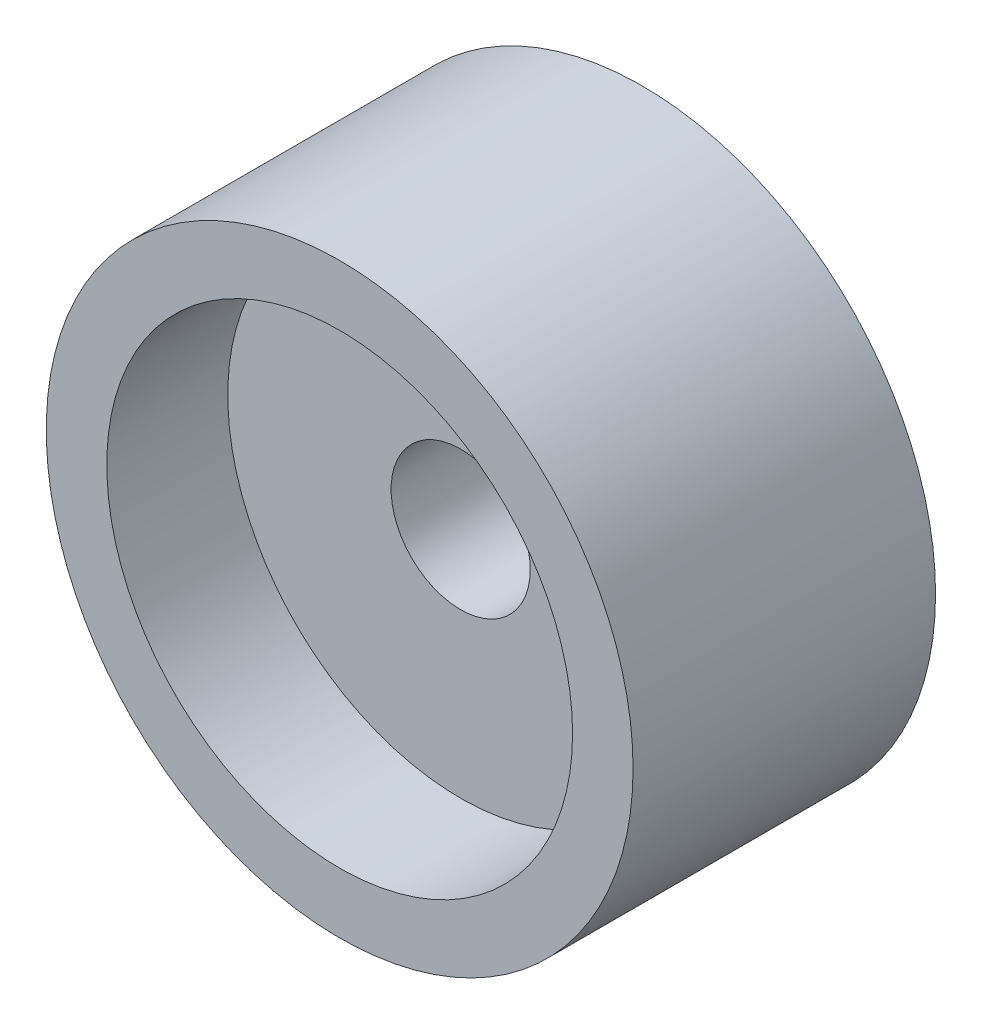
ISO-10303-21;
HEADER;
FILE_DESCRIPTION(('STEP AP214'),'2;1');
FILE_NAME('part.step','',(''),(''),'','','');
FILE_SCHEMA(('AUTOMOTIVE_DESIGN { 1 0 10303 214 1 1 1 1 }'));
ENDSEC;
DATA;
#1=APPLICATION_CONTEXT('core data for automotive mechanical design processes');
#2=APPLICATION_PROTOCOL_DEFINITION('international standard','automotive_design',2000,#1);
#3=PRODUCT_CONTEXT('',#1,'mechanical');
#4=PRODUCT('Part','Part','',(#3));
#5=PRODUCT_RELATED_PRODUCT_CATEGORY('part','',(#4));
#6=PRODUCT_DEFINITION_FORMATION('','',#4);
#7=PRODUCT_DEFINITION_CONTEXT('part definition',#1,'design');
#8=PRODUCT_DEFINITION('design','',#6,#7);
#9=PRODUCT_DEFINITION_SHAPE('','',#8);
#10=(LENGTH_UNIT() NAMED_UNIT(*) SI_UNIT(.MILLI.,.METRE.));
#11=(NAMED_UNIT(*) PLANE_ANGLE_UNIT() SI_UNIT($,.RADIAN.));
#12=(NAMED_UNIT(*) SI_UNIT($,.STERADIAN.) SOLID_ANGLE_UNIT());
#13=UNCERTAINTY_MEASURE_WITH_UNIT(LENGTH_MEASURE(1.E-05),#10,'distance_accuracy_value','');
#14=(GEOMETRIC_REPRESENTATION_CONTEXT(3) GLOBAL_UNCERTAINTY_ASSIGNED_CONTEXT((#13)) GLOBAL_UNIT_ASSIGNED_CONTEXT((#10,
#11,#12)) REPRESENTATION_CONTEXT('',''));
#15=CARTESIAN_POINT('',(0.,0.,0.));
#16=DIRECTION('',(0.,0.,1.));
#17=DIRECTION('',(1.,0.,0.));
#18=AXIS2_PLACEMENT_3D('',#15,#16,#17);
#19=CARTESIAN_POINT('',(0.,0.,2.));
#20=DIRECTION('',(0.,0.,-1.));
#21=DIRECTION('',(-1.,0.,0.));
#22=AXIS2_PLACEMENT_3D('',#19,#20,#21);
#23=CYLINDRICAL_SURFACE('',#22,3.85);
#24=CARTESIAN_POINT('',(0.,0.,2.));
#25=DIRECTION('',(0.,0.,1.));
#26=DIRECTION('',(1.,0.,0.));
#27=AXIS2_PLACEMENT_3D('',#24,#25,#26);
#28=CIRCLE('',#27,3.85);
#29=CARTESIAN_POINT('',(3.85,0.,2.));
#30=VERTEX_POINT('',#29);
#31=EDGE_CURVE('E47',#30,#30,#28,.T.);
#32=ORIENTED_EDGE('',*,*,#31,.T.);
#33=EDGE_LOOP('',(#32));
#34=FACE_BOUND('',#33,.T.);
#35=CARTESIAN_POINT('',(0.,0.,0.));
#36=DIRECTION('',(0.,0.,1.));
#37=DIRECTION('',(1.,0.,0.));
#38=AXIS2_PLACEMENT_3D('',#35,#36,#37);
#39=CIRCLE('',#38,3.85);
#40=CARTESIAN_POINT('',(3.85,0.,0.));
#41=VERTEX_POINT('',#40);
#42=EDGE_CURVE('E42',#41,#41,#39,.T.);
#43=ORIENTED_EDGE('',*,*,#42,.F.);
#44=EDGE_LOOP('',(#43));
#45=FACE_BOUND('',#44,.T.);
#46=ADVANCED_FACE('F39',(#34,#45),#23,.F.);
#47=CARTESIAN_POINT('',(0.,0.,2.));
#48=DIRECTION('',(0.,0.,-1.));
#49=DIRECTION('',(-1.,0.,0.));
#50=AXIS2_PLACEMENT_3D('',#47,#48,#49);
#51=CYLINDRICAL_SURFACE('',#50,4.85);
#52=CARTESIAN_POINT('',(0.,0.,2.));
#53=DIRECTION('',(0.,0.,1.));
#54=DIRECTION('',(1.,0.,0.));
#55=AXIS2_PLACEMENT_3D('',#52,#53,#54);
#56=CIRCLE('',#55,4.85);
#57=CARTESIAN_POINT('',(4.85,0.,2.));
#58=VERTEX_POINT('',#57);
#59=EDGE_CURVE('E10',#58,#58,#56,.T.);
#60=ORIENTED_EDGE('',*,*,#59,.F.);
#61=EDGE_LOOP('',(#60));
#62=FACE_BOUND('',#61,.T.);
#63=CARTESIAN_POINT('',(0.,0.,-3.));
#64=DIRECTION('',(0.,0.,1.));
#65=DIRECTION('',(1.,0.,0.));
#66=AXIS2_PLACEMENT_3D('',#63,#64,#65);
#67=CIRCLE('',#66,4.85);
#68=CARTESIAN_POINT('',(4.85,0.,-3.));
#69=VERTEX_POINT('',#68);
#70=EDGE_CURVE('E59',#69,#69,#67,.T.);
#71=ORIENTED_EDGE('',*,*,#70,.T.);
#72=EDGE_LOOP('',(#71));
#73=FACE_BOUND('',#72,.T.);
#74=ADVANCED_FACE('F86',(#62,#73),#51,.T.);
#75=CARTESIAN_POINT('',(0.,0.,2.));
#76=DIRECTION('',(0.,0.,1.));
#77=DIRECTION('',(1.,0.,0.));
#78=AXIS2_PLACEMENT_3D('',#75,#76,#77);
#79=PLANE('',#78);
#80=ORIENTED_EDGE('',*,*,#31,.F.);
#81=EDGE_LOOP('',(#80));
#82=FACE_BOUND('',#81,.T.);
#83=ORIENTED_EDGE('',*,*,#59,.T.);
#84=EDGE_LOOP('',(#83));
#85=FACE_BOUND('',#84,.T.);
#86=ADVANCED_FACE('F79',(#82,#85),#79,.T.);
#87=CARTESIAN_POINT('',(0.,0.,0.));
#88=DIRECTION('',(0.,0.,1.));
#89=DIRECTION('',(1.,0.,0.));
#90=AXIS2_PLACEMENT_3D('',#87,#88,#89);
#91=PLANE('',#90);
#92=CARTESIAN_POINT('',(0.,0.,0.));
#93=DIRECTION('',(0.,0.,1.));
#94=DIRECTION('',(1.,0.,0.));
#95=AXIS2_PLACEMENT_3D('',#92,#93,#94);
#96=CIRCLE('',#95,1.15);
#97=CARTESIAN_POINT('',(1.15,0.,0.));
#98=VERTEX_POINT('',#97);
#99=EDGE_CURVE('E54',#98,#98,#96,.T.);
#100=ORIENTED_EDGE('',*,*,#99,.F.);
#101=EDGE_LOOP('',(#100));
#102=FACE_BOUND('',#101,.T.);
#103=ORIENTED_EDGE('',*,*,#42,.T.);
#104=EDGE_LOOP('',(#103));
#105=FACE_BOUND('',#104,.T.);
#106=ADVANCED_FACE('F73',(#102,#105),#91,.T.);
#107=CARTESIAN_POINT('',(0.,0.,-3.));
#108=DIRECTION('',(0.,0.,1.));
#109=DIRECTION('',(1.,0.,0.));
#110=AXIS2_PLACEMENT_3D('',#107,#108,#109);
#111=CYLINDRICAL_SURFACE('',#110,1.15);
#112=CARTESIAN_POINT('',(0.,0.,-3.));
#113=DIRECTION('',(0.,0.,1.));
#114=DIRECTION('',(1.,0.,0.));
#115=AXIS2_PLACEMENT_3D('',#112,#113,#114);
#116=CIRCLE('',#115,1.15);
#117=CARTESIAN_POINT('',(1.15,0.,-3.));
#118=VERTEX_POINT('',#117);
#119=EDGE_CURVE('E58',#118,#118,#116,.T.);
#120=ORIENTED_EDGE('',*,*,#119,.F.);
#121=EDGE_LOOP('',(#120));
#122=FACE_BOUND('',#121,.T.);
#123=ORIENTED_EDGE('',*,*,#99,.T.);
#124=EDGE_LOOP('',(#123));
#125=FACE_BOUND('',#124,.T.);
#126=ADVANCED_FACE('F70',(#122,#125),#111,.F.);
#127=CARTESIAN_POINT('',(0.,0.,-3.));
#128=DIRECTION('',(0.,0.,1.));
#129=DIRECTION('',(1.,0.,0.));
#130=AXIS2_PLACEMENT_3D('',#127,#128,#129);
#131=PLANE('',#130);
#132=ORIENTED_EDGE('',*,*,#119,.T.);
#133=EDGE_LOOP('',(#132));
#134=FACE_BOUND('',#133,.T.);
#135=ORIENTED_EDGE('',*,*,#70,.F.);
#136=EDGE_LOOP('',(#135));
#137=FACE_BOUND('',#136,.T.);
#138=ADVANCED_FACE('F67',(#134,#137),#131,.F.);
#139=CLOSED_SHELL('',(#46,#74,#86,#106,#126,#138));
#140=MANIFOLD_SOLID_BREP('B2',#139);
#141=ADVANCED_BREP_SHAPE_REPRESENTATION('',(#18,#140),#14);
#142=SHAPE_DEFINITION_REPRESENTATION(#9,#141);
ENDSEC;
END-ISO-10303-21;
